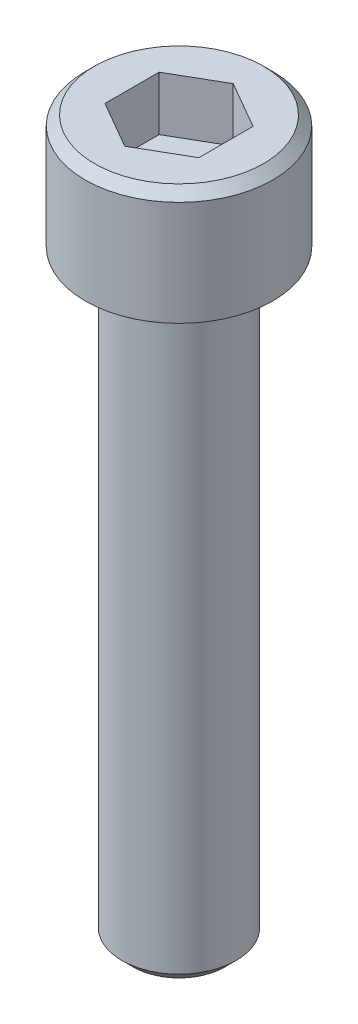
ISO-10303-21;
HEADER;
FILE_DESCRIPTION(('STEP AP214'),'2;1');
FILE_NAME('part.step','',(''),(''),'','','');
FILE_SCHEMA(('AUTOMOTIVE_DESIGN { 1 0 10303 214 1 1 1 1 }'));
ENDSEC;
DATA;
#1=APPLICATION_CONTEXT('core data for automotive mechanical design processes');
#2=APPLICATION_PROTOCOL_DEFINITION('international standard','automotive_design',2000,#1);
#3=PRODUCT_CONTEXT('',#1,'mechanical');
#4=PRODUCT('Part','Part','',(#3));
#5=PRODUCT_RELATED_PRODUCT_CATEGORY('part','',(#4));
#6=PRODUCT_DEFINITION_FORMATION('','',#4);
#7=PRODUCT_DEFINITION_CONTEXT('part definition',#1,'design');
#8=PRODUCT_DEFINITION('design','',#6,#7);
#9=PRODUCT_DEFINITION_SHAPE('','',#8);
#10=(LENGTH_UNIT() NAMED_UNIT(*) SI_UNIT(.MILLI.,.METRE.));
#11=(NAMED_UNIT(*) PLANE_ANGLE_UNIT() SI_UNIT($,.RADIAN.));
#12=(NAMED_UNIT(*) SI_UNIT($,.STERADIAN.) SOLID_ANGLE_UNIT());
#13=UNCERTAINTY_MEASURE_WITH_UNIT(LENGTH_MEASURE(1.E-05),#10,'distance_accuracy_value','');
#14=(GEOMETRIC_REPRESENTATION_CONTEXT(3) GLOBAL_UNCERTAINTY_ASSIGNED_CONTEXT((#13)) GLOBAL_UNIT_ASSIGNED_CONTEXT((#10,
#11,#12)) REPRESENTATION_CONTEXT('',''));
#15=CARTESIAN_POINT('',(0.,0.,0.));
#16=DIRECTION('',(0.,0.,1.));
#17=DIRECTION('',(1.,0.,0.));
#18=AXIS2_PLACEMENT_3D('',#15,#16,#17);
#19=CARTESIAN_POINT('',(1.11022302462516E-13,0.,0.));
#20=DIRECTION('',(0.,-1.,0.));
#21=DIRECTION('',(0.,0.,-1.));
#22=AXIS2_PLACEMENT_3D('',#19,#20,#21);
#23=PLANE('',#22);
#24=CARTESIAN_POINT('',(1.11022302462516E-13,0.,0.));
#25=DIRECTION('',(0.,-1.,0.));
#26=DIRECTION('',(0.,0.,-1.));
#27=AXIS2_PLACEMENT_3D('',#24,#25,#26);
#28=CIRCLE('',#27,2.413);
#29=CARTESIAN_POINT('',(1.11022302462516E-13,0.,-2.413));
#30=VERTEX_POINT('',#29);
#31=EDGE_CURVE('E11',#30,#30,#28,.T.);
#32=ORIENTED_EDGE('',*,*,#31,.F.);
#33=EDGE_LOOP('',(#32));
#34=FACE_BOUND('',#33,.T.);
#35=CARTESIAN_POINT('',(1.11022302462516E-13,0.,0.));
#36=DIRECTION('',(0.,-1.,0.));
#37=DIRECTION('',(0.,0.,-1.));
#38=AXIS2_PLACEMENT_3D('',#35,#36,#37);
#39=CIRCLE('',#38,3.96875);
#40=CARTESIAN_POINT('',(1.11022302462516E-13,0.,-3.96875));
#41=VERTEX_POINT('',#40);
#42=EDGE_CURVE('E39',#41,#41,#39,.T.);
#43=ORIENTED_EDGE('',*,*,#42,.T.);
#44=EDGE_LOOP('',(#43));
#45=FACE_BOUND('',#44,.T.);
#46=ADVANCED_FACE('F32',(#34,#45),#23,.T.);
#47=CARTESIAN_POINT('',(1.11022302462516E-13,0.,0.));
#48=DIRECTION('',(0.,-1.,0.));
#49=DIRECTION('',(0.,0.,-1.));
#50=AXIS2_PLACEMENT_3D('',#47,#48,#49);
#51=CYLINDRICAL_SURFACE('',#50,3.96875);
#52=CARTESIAN_POINT('',(-1.94289029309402E-13,4.42912500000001,-1.66533453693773E-13));
#53=DIRECTION('',(0.,-1.,0.));
#54=DIRECTION('',(0.,0.,-1.));
#55=AXIS2_PLACEMENT_3D('',#52,#53,#54);
#56=CIRCLE('',#55,3.96875);
#57=CARTESIAN_POINT('',(-1.94289029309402E-13,4.42912500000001,-3.96875000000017));
#58=VERTEX_POINT('',#57);
#59=EDGE_CURVE('E149',#58,#58,#56,.T.);
#60=ORIENTED_EDGE('',*,*,#59,.T.);
#61=EDGE_LOOP('',(#60));
#62=FACE_BOUND('',#61,.T.);
#63=ORIENTED_EDGE('',*,*,#42,.F.);
#64=EDGE_LOOP('',(#63));
#65=FACE_BOUND('',#64,.T.);
#66=ADVANCED_FACE('F155',(#62,#65),#51,.T.);
#67=CARTESIAN_POINT('',(-1.94289029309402E-13,4.42912500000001,-1.66533453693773E-13));
#68=DIRECTION('',(0.,-1.,0.));
#69=DIRECTION('',(0.,0.,-1.));
#70=AXIS2_PLACEMENT_3D('',#67,#68,#69);
#71=CONICAL_SURFACE('',#70,3.96875,0.785398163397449);
#72=CARTESIAN_POINT('',(-1.94289029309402E-13,4.826,-1.66533453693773E-13));
#73=DIRECTION('',(0.,-1.,0.));
#74=DIRECTION('',(0.,0.,-1.));
#75=AXIS2_PLACEMENT_3D('',#72,#73,#74);
#76=CIRCLE('',#75,3.571875);
#77=CARTESIAN_POINT('',(-1.94289029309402E-13,4.826,-3.57187500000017));
#78=VERTEX_POINT('',#77);
#79=EDGE_CURVE('E146',#78,#78,#76,.T.);
#80=ORIENTED_EDGE('',*,*,#79,.T.);
#81=EDGE_LOOP('',(#80));
#82=FACE_BOUND('',#81,.T.);
#83=ORIENTED_EDGE('',*,*,#59,.F.);
#84=EDGE_LOOP('',(#83));
#85=FACE_BOUND('',#84,.T.);
#86=ADVANCED_FACE('F157',(#82,#85),#71,.T.);
#87=CARTESIAN_POINT('',(3.57187499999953,4.82600000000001,0.));
#88=DIRECTION('',(0.,1.,0.));
#89=DIRECTION('',(0.,0.,1.));
#90=AXIS2_PLACEMENT_3D('',#87,#88,#89);
#91=PLANE('',#90);
#92=DIRECTION('',(1.02056696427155E-11,0.,1.));
#93=VECTOR('',#92,1.);
#94=CARTESIAN_POINT('',(-1.98501000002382,4.826,-1.14604605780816));
#95=LINE('',#94,#93);
#96=CARTESIAN_POINT('',(-1.98501000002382,4.826,-1.14604605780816));
#97=VERTEX_POINT('',#96);
#98=CARTESIAN_POINT('',(-1.98501000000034,4.826,1.14604605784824));
#99=VERTEX_POINT('',#98);
#100=EDGE_CURVE('E46',#97,#99,#95,.T.);
#101=ORIENTED_EDGE('',*,*,#100,.F.);
#102=DIRECTION('',(-0.866025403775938,0.,0.500000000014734));
#103=VECTOR('',#102,1.);
#104=CARTESIAN_POINT('',(-3.54716256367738E-11,4.826,-2.29209211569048));
#105=LINE('',#104,#103);
#106=CARTESIAN_POINT('',(-3.54716256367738E-11,4.826,-2.29209211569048));
#107=VERTEX_POINT('',#106);
#108=EDGE_CURVE('E116',#107,#97,#105,.T.);
#109=ORIENTED_EDGE('',*,*,#108,.F.);
#110=DIRECTION('',(-0.866025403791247,0.,-0.499999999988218));
#111=VECTOR('',#110,1.);
#112=CARTESIAN_POINT('',(1.98500999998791,4.826,-1.14604605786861));
#113=LINE('',#112,#111);
#114=CARTESIAN_POINT('',(1.98500999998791,4.826,-1.14604605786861));
#115=VERTEX_POINT('',#114);
#116=EDGE_CURVE('E110',#115,#107,#113,.T.);
#117=ORIENTED_EDGE('',*,*,#116,.F.);
#118=DIRECTION('',(-1.02056696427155E-11,0.,-1.));
#119=VECTOR('',#118,1.);
#120=CARTESIAN_POINT('',(1.98501000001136,4.82600000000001,1.1460460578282));
#121=LINE('',#120,#119);
#122=CARTESIAN_POINT('',(1.98501000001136,4.82600000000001,1.1460460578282));
#123=VERTEX_POINT('',#122);
#124=EDGE_CURVE('E108',#123,#115,#121,.T.);
#125=ORIENTED_EDGE('',*,*,#124,.F.);
#126=DIRECTION('',(0.86602540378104,0.,-0.500000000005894));
#127=VECTOR('',#126,1.);
#128=CARTESIAN_POINT('',(1.13242748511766E-11,4.826,2.29209211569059));
#129=LINE('',#128,#127);
#130=CARTESIAN_POINT('',(1.13242748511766E-11,4.826,2.29209211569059));
#131=VERTEX_POINT('',#130);
#132=EDGE_CURVE('E89',#131,#123,#129,.T.);
#133=ORIENTED_EDGE('',*,*,#132,.F.);
#134=DIRECTION('',(0.866025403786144,0.,0.499999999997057));
#135=VECTOR('',#134,1.);
#136=CARTESIAN_POINT('',(-1.98501000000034,4.826,1.14604605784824));
#137=LINE('',#136,#135);
#138=EDGE_CURVE('E100',#99,#131,#137,.T.);
#139=ORIENTED_EDGE('',*,*,#138,.F.);
#140=EDGE_LOOP('',(#101,#109,#117,#125,#133,#139));
#141=FACE_BOUND('',#140,.T.);
#142=ORIENTED_EDGE('',*,*,#79,.F.);
#143=EDGE_LOOP('',(#142));
#144=FACE_BOUND('',#143,.T.);
#145=ADVANCED_FACE('F104',(#141,#144),#91,.T.);
#146=CARTESIAN_POINT('',(0.,-25.4000000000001,-1.66533453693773E-13));
#147=DIRECTION('',(0.,-1.,0.));
#148=DIRECTION('',(0.,0.,-1.));
#149=AXIS2_PLACEMENT_3D('',#146,#147,#148);
#150=PLANE('',#149);
#151=CARTESIAN_POINT('',(0.,-25.4000000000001,-1.66533453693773E-13));
#152=DIRECTION('',(0.,-1.,0.));
#153=DIRECTION('',(0.,0.,-1.));
#154=AXIS2_PLACEMENT_3D('',#151,#152,#153);
#155=CIRCLE('',#154,1.94056);
#156=CARTESIAN_POINT('',(0.,-25.4000000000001,-1.94056000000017));
#157=VERTEX_POINT('',#156);
#158=EDGE_CURVE('E143',#157,#157,#155,.T.);
#159=ORIENTED_EDGE('',*,*,#158,.T.);
#160=EDGE_LOOP('',(#159));
#161=FACE_BOUND('',#160,.T.);
#162=ADVANCED_FACE('F169',(#161),#150,.T.);
#163=CARTESIAN_POINT('',(0.,-25.4000000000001,-1.66533453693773E-13));
#164=DIRECTION('',(0.,1.,0.));
#165=DIRECTION('',(0.,0.,1.));
#166=AXIS2_PLACEMENT_3D('',#163,#164,#165);
#167=CONICAL_SURFACE('',#166,1.94056,0.785398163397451);
#168=CARTESIAN_POINT('',(0.,-24.9275600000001,-1.66533453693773E-13));
#169=DIRECTION('',(0.,-1.,0.));
#170=DIRECTION('',(0.,0.,-1.));
#171=AXIS2_PLACEMENT_3D('',#168,#169,#170);
#172=CIRCLE('',#171,2.413);
#173=CARTESIAN_POINT('',(0.,-24.9275600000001,-2.41300000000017));
#174=VERTEX_POINT('',#173);
#175=EDGE_CURVE('E134',#174,#174,#172,.T.);
#176=ORIENTED_EDGE('',*,*,#175,.T.);
#177=EDGE_LOOP('',(#176));
#178=FACE_BOUND('',#177,.T.);
#179=ORIENTED_EDGE('',*,*,#158,.F.);
#180=EDGE_LOOP('',(#179));
#181=FACE_BOUND('',#180,.T.);
#182=ADVANCED_FACE('F172',(#178,#181),#167,.T.);
#183=CARTESIAN_POINT('',(1.11022302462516E-13,0.,0.));
#184=DIRECTION('',(0.,-1.,0.));
#185=DIRECTION('',(0.,0.,-1.));
#186=AXIS2_PLACEMENT_3D('',#183,#184,#185);
#187=CYLINDRICAL_SURFACE('',#186,2.413);
#188=ORIENTED_EDGE('',*,*,#31,.T.);
#189=EDGE_LOOP('',(#188));
#190=FACE_BOUND('',#189,.T.);
#191=ORIENTED_EDGE('',*,*,#175,.F.);
#192=EDGE_LOOP('',(#191));
#193=FACE_BOUND('',#192,.T.);
#194=ADVANCED_FACE('F176',(#190,#193),#187,.T.);
#195=CARTESIAN_POINT('',(-1.98501000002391,2.54,-1.14604605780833));
#196=DIRECTION('',(-1.,0.,1.02056696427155E-11));
#197=DIRECTION('',(1.02056696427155E-11,0.,1.));
#198=AXIS2_PLACEMENT_3D('',#195,#196,#197);
#199=PLANE('',#198);
#200=ORIENTED_EDGE('',*,*,#100,.T.);
#201=DIRECTION('',(0.,1.,0.));
#202=VECTOR('',#201,1.);
#203=CARTESIAN_POINT('',(-1.98501000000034,2.54,1.14604605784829));
#204=LINE('',#203,#202);
#205=CARTESIAN_POINT('',(-1.98501000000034,2.54,1.14604605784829));
#206=VERTEX_POINT('',#205);
#207=EDGE_CURVE('E97',#206,#99,#204,.T.);
#208=ORIENTED_EDGE('',*,*,#207,.F.);
#209=DIRECTION('',(1.02056696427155E-11,0.,1.));
#210=VECTOR('',#209,1.);
#211=CARTESIAN_POINT('',(-1.98501000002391,2.54,-1.14604605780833));
#212=LINE('',#211,#210);
#213=CARTESIAN_POINT('',(-1.98501000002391,2.54,-1.14604605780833));
#214=VERTEX_POINT('',#213);
#215=EDGE_CURVE('E118',#214,#206,#212,.T.);
#216=ORIENTED_EDGE('',*,*,#215,.F.);
#217=DIRECTION('',(0.,1.,0.));
#218=VECTOR('',#217,1.);
#219=CARTESIAN_POINT('',(-1.98501000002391,2.54,-1.14604605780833));
#220=LINE('',#219,#218);
#221=EDGE_CURVE('E53',#214,#97,#220,.T.);
#222=ORIENTED_EDGE('',*,*,#221,.T.);
#223=EDGE_LOOP('',(#200,#208,#216,#222));
#224=FACE_BOUND('',#223,.T.);
#225=ADVANCED_FACE('F180',(#224),#199,.F.);
#226=CARTESIAN_POINT('',(-3.54716256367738E-11,2.53999999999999,-2.29209211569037));
#227=DIRECTION('',(-0.500000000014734,0.,-0.866025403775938));
#228=DIRECTION('',(-0.866025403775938,0.,0.500000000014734));
#229=AXIS2_PLACEMENT_3D('',#226,#227,#228);
#230=PLANE('',#229);
#231=ORIENTED_EDGE('',*,*,#108,.T.);
#232=ORIENTED_EDGE('',*,*,#221,.F.);
#233=DIRECTION('',(-0.866025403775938,0.,0.500000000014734));
#234=VECTOR('',#233,1.);
#235=CARTESIAN_POINT('',(-3.54716256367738E-11,2.53999999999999,-2.29209211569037));
#236=LINE('',#235,#234);
#237=CARTESIAN_POINT('',(-3.54716256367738E-11,2.53999999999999,-2.29209211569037));
#238=VERTEX_POINT('',#237);
#239=EDGE_CURVE('E130',#238,#214,#236,.T.);
#240=ORIENTED_EDGE('',*,*,#239,.F.);
#241=DIRECTION('',(0.,1.,0.));
#242=VECTOR('',#241,1.);
#243=CARTESIAN_POINT('',(-3.54716256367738E-11,2.53999999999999,-2.29209211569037));
#244=LINE('',#243,#242);
#245=EDGE_CURVE('E135',#238,#107,#244,.T.);
#246=ORIENTED_EDGE('',*,*,#245,.T.);
#247=EDGE_LOOP('',(#231,#232,#240,#246));
#248=FACE_BOUND('',#247,.T.);
#249=ADVANCED_FACE('F184',(#248),#230,.F.);
#250=CARTESIAN_POINT('',(1.98500999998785,2.54,-1.14604605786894));
#251=DIRECTION('',(0.499999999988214,0.,-0.866025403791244));
#252=DIRECTION('',(-0.866025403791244,0.,-0.499999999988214));
#253=AXIS2_PLACEMENT_3D('',#250,#251,#252);
#254=PLANE('',#253);
#255=ORIENTED_EDGE('',*,*,#116,.T.);
#256=ORIENTED_EDGE('',*,*,#245,.F.);
#257=DIRECTION('',(-0.866025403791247,0.,-0.499999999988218));
#258=VECTOR('',#257,1.);
#259=CARTESIAN_POINT('',(1.98500999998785,2.54,-1.14604605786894));
#260=LINE('',#259,#258);
#261=CARTESIAN_POINT('',(1.98500999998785,2.54,-1.14604605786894));
#262=VERTEX_POINT('',#261);
#263=EDGE_CURVE('E127',#262,#238,#260,.T.);
#264=ORIENTED_EDGE('',*,*,#263,.F.);
#265=DIRECTION('',(0.,1.,0.));
#266=VECTOR('',#265,1.);
#267=CARTESIAN_POINT('',(1.98500999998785,2.54,-1.14604605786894));
#268=LINE('',#267,#266);
#269=EDGE_CURVE('E137',#262,#115,#268,.T.);
#270=ORIENTED_EDGE('',*,*,#269,.T.);
#271=EDGE_LOOP('',(#255,#256,#264,#270));
#272=FACE_BOUND('',#271,.T.);
#273=ADVANCED_FACE('F193',(#272),#254,.F.);
#274=CARTESIAN_POINT('',(1.9850100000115,2.54,1.14604605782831));
#275=DIRECTION('',(1.,0.,-1.02056696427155E-11));
#276=DIRECTION('',(-1.02056696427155E-11,0.,-1.));
#277=AXIS2_PLACEMENT_3D('',#274,#275,#276);
#278=PLANE('',#277);
#279=ORIENTED_EDGE('',*,*,#124,.T.);
#280=ORIENTED_EDGE('',*,*,#269,.F.);
#281=DIRECTION('',(-1.02056696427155E-11,0.,-1.));
#282=VECTOR('',#281,1.);
#283=CARTESIAN_POINT('',(1.9850100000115,2.54,1.14604605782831));
#284=LINE('',#283,#282);
#285=CARTESIAN_POINT('',(1.9850100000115,2.54,1.14604605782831));
#286=VERTEX_POINT('',#285);
#287=EDGE_CURVE('E124',#286,#262,#284,.T.);
#288=ORIENTED_EDGE('',*,*,#287,.F.);
#289=DIRECTION('',(0.,1.,0.));
#290=VECTOR('',#289,1.);
#291=CARTESIAN_POINT('',(1.9850100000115,2.54,1.14604605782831));
#292=LINE('',#291,#290);
#293=EDGE_CURVE('E96',#286,#123,#292,.T.);
#294=ORIENTED_EDGE('',*,*,#293,.T.);
#295=EDGE_LOOP('',(#279,#280,#288,#294));
#296=FACE_BOUND('',#295,.T.);
#297=ADVANCED_FACE('F190',(#296),#278,.F.);
#298=CARTESIAN_POINT('',(1.13242748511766E-11,2.54,2.29209211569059));
#299=DIRECTION('',(0.500000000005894,0.,0.86602540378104));
#300=DIRECTION('',(0.86602540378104,0.,-0.500000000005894));
#301=AXIS2_PLACEMENT_3D('',#298,#299,#300);
#302=PLANE('',#301);
#303=ORIENTED_EDGE('',*,*,#132,.T.);
#304=ORIENTED_EDGE('',*,*,#293,.F.);
#305=DIRECTION('',(0.86602540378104,0.,-0.500000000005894));
#306=VECTOR('',#305,1.);
#307=CARTESIAN_POINT('',(1.13242748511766E-11,2.54,2.29209211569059));
#308=LINE('',#307,#306);
#309=CARTESIAN_POINT('',(1.13242748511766E-11,2.54,2.29209211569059));
#310=VERTEX_POINT('',#309);
#311=EDGE_CURVE('E92',#310,#286,#308,.T.);
#312=ORIENTED_EDGE('',*,*,#311,.F.);
#313=DIRECTION('',(0.,1.,0.));
#314=VECTOR('',#313,1.);
#315=CARTESIAN_POINT('',(1.13242748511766E-11,2.54,2.29209211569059));
#316=LINE('',#315,#314);
#317=EDGE_CURVE('E85',#310,#131,#316,.T.);
#318=ORIENTED_EDGE('',*,*,#317,.T.);
#319=EDGE_LOOP('',(#303,#304,#312,#318));
#320=FACE_BOUND('',#319,.T.);
#321=ADVANCED_FACE('F87',(#320),#302,.F.);
#322=CARTESIAN_POINT('',(-1.98501000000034,2.54,1.14604605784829));
#323=DIRECTION('',(-0.499999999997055,0.,0.866025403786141));
#324=DIRECTION('',(0.866025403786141,0.,0.499999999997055));
#325=AXIS2_PLACEMENT_3D('',#322,#323,#324);
#326=PLANE('',#325);
#327=ORIENTED_EDGE('',*,*,#138,.T.);
#328=ORIENTED_EDGE('',*,*,#317,.F.);
#329=DIRECTION('',(0.866025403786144,0.,0.499999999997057));
#330=VECTOR('',#329,1.);
#331=CARTESIAN_POINT('',(-1.98501000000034,2.54,1.14604605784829));
#332=LINE('',#331,#330);
#333=EDGE_CURVE('E121',#206,#310,#332,.T.);
#334=ORIENTED_EDGE('',*,*,#333,.F.);
#335=ORIENTED_EDGE('',*,*,#207,.T.);
#336=EDGE_LOOP('',(#327,#328,#334,#335));
#337=FACE_BOUND('',#336,.T.);
#338=ADVANCED_FACE('F101',(#337),#326,.F.);
#339=CARTESIAN_POINT('',(-1.98501000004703,2.54,-3.43813817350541));
#340=DIRECTION('',(0.,-1.,0.));
#341=DIRECTION('',(0.,0.,-1.));
#342=AXIS2_PLACEMENT_3D('',#339,#340,#341);
#343=PLANE('',#342);
#344=ORIENTED_EDGE('',*,*,#215,.T.);
#345=ORIENTED_EDGE('',*,*,#333,.T.);
#346=ORIENTED_EDGE('',*,*,#311,.T.);
#347=ORIENTED_EDGE('',*,*,#287,.T.);
#348=ORIENTED_EDGE('',*,*,#263,.T.);
#349=ORIENTED_EDGE('',*,*,#239,.T.);
#350=EDGE_LOOP('',(#344,#345,#346,#347,#348,#349));
#351=FACE_BOUND('',#350,.T.);
#352=ADVANCED_FACE('F187',(#351),#343,.F.);
#353=CLOSED_SHELL('',(#46,#66,#86,#145,#162,#182,#194,#225,#249,#273,#297,#321,#338,#352));
#354=MANIFOLD_SOLID_BREP('B2',#353);
#355=ADVANCED_BREP_SHAPE_REPRESENTATION('',(#18,#354),#14);
#356=SHAPE_DEFINITION_REPRESENTATION(#9,#355);
ENDSEC;
END-ISO-10303-21;
